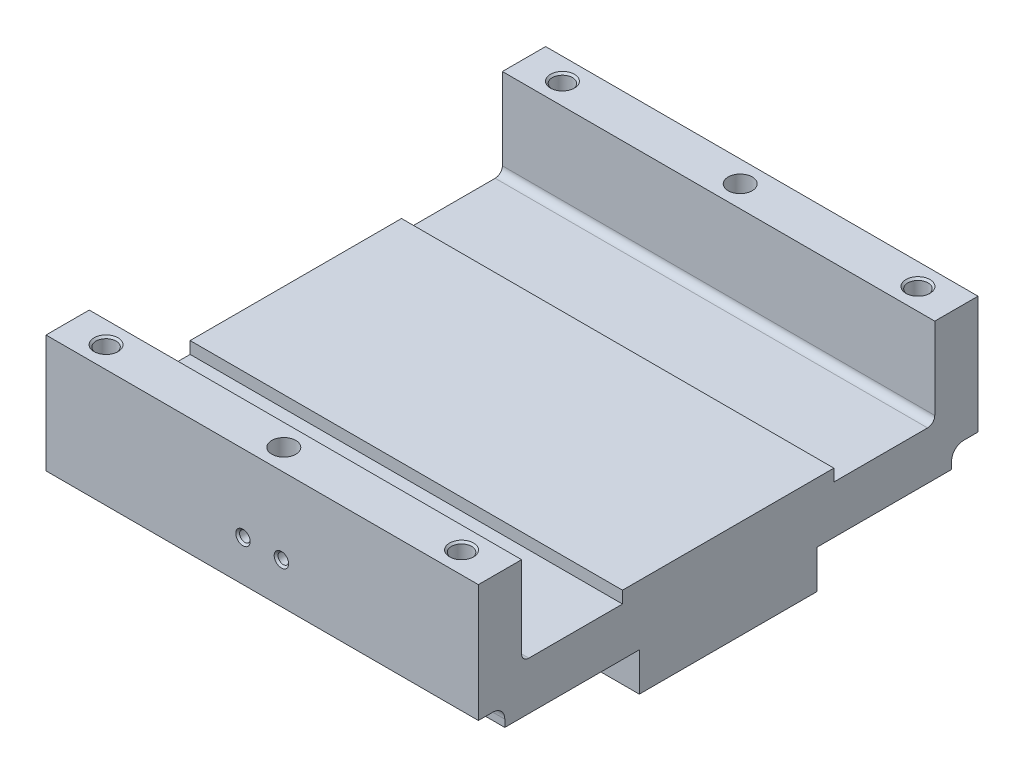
ISO-10303-21;
HEADER;
FILE_DESCRIPTION(('STEP AP214'),'2;1');
FILE_NAME('part.step','',(''),(''),'','','');
FILE_SCHEMA(('AUTOMOTIVE_DESIGN { 1 0 10303 214 1 1 1 1 }'));
ENDSEC;
DATA;
#1=APPLICATION_CONTEXT('core data for automotive mechanical design processes');
#2=APPLICATION_PROTOCOL_DEFINITION('international standard','automotive_design',2000,#1);
#3=PRODUCT_CONTEXT('',#1,'mechanical');
#4=PRODUCT('Part','Part','',(#3));
#5=PRODUCT_RELATED_PRODUCT_CATEGORY('part','',(#4));
#6=PRODUCT_DEFINITION_FORMATION('','',#4);
#7=PRODUCT_DEFINITION_CONTEXT('part definition',#1,'design');
#8=PRODUCT_DEFINITION('design','',#6,#7);
#9=PRODUCT_DEFINITION_SHAPE('','',#8);
#10=(LENGTH_UNIT() NAMED_UNIT(*) SI_UNIT(.MILLI.,.METRE.));
#11=(NAMED_UNIT(*) PLANE_ANGLE_UNIT() SI_UNIT($,.RADIAN.));
#12=(NAMED_UNIT(*) SI_UNIT($,.STERADIAN.) SOLID_ANGLE_UNIT());
#13=UNCERTAINTY_MEASURE_WITH_UNIT(LENGTH_MEASURE(1.E-05),#10,'distance_accuracy_value','');
#14=(GEOMETRIC_REPRESENTATION_CONTEXT(3) GLOBAL_UNCERTAINTY_ASSIGNED_CONTEXT((#13)) GLOBAL_UNIT_ASSIGNED_CONTEXT((#10,
#11,#12)) REPRESENTATION_CONTEXT('',''));
#15=CARTESIAN_POINT('',(0.,0.,0.));
#16=DIRECTION('',(0.,0.,1.));
#17=DIRECTION('',(1.,0.,0.));
#18=AXIS2_PLACEMENT_3D('',#15,#16,#17);
#19=CARTESIAN_POINT('',(-5.,55.,47.5));
#20=DIRECTION('',(0.,1.,0.));
#21=DIRECTION('',(0.,0.,1.));
#22=AXIS2_PLACEMENT_3D('',#19,#20,#21);
#23=PLANE('',#22);
#24=CARTESIAN_POINT('',(-5.,55.,47.5));
#25=DIRECTION('',(0.,1.,0.));
#26=DIRECTION('',(0.,0.,1.));
#27=AXIS2_PLACEMENT_3D('',#24,#25,#26);
#28=CIRCLE('',#27,2.1);
#29=CARTESIAN_POINT('',(-5.,55.,49.6));
#30=VERTEX_POINT('',#29);
#31=EDGE_CURVE('E20',#30,#30,#28,.T.);
#32=ORIENTED_EDGE('',*,*,#31,.T.);
#33=EDGE_LOOP('',(#32));
#34=FACE_BOUND('',#33,.T.);
#35=ADVANCED_FACE('F17',(#34),#23,.T.);
#36=CARTESIAN_POINT('',(-79.,55.,47.5));
#37=DIRECTION('',(0.,1.,0.));
#38=DIRECTION('',(0.,0.,1.));
#39=AXIS2_PLACEMENT_3D('',#36,#37,#38);
#40=PLANE('',#39);
#41=CARTESIAN_POINT('',(-79.,55.,47.5));
#42=DIRECTION('',(0.,1.,0.));
#43=DIRECTION('',(0.,0.,1.));
#44=AXIS2_PLACEMENT_3D('',#41,#42,#43);
#45=CIRCLE('',#44,2.1);
#46=CARTESIAN_POINT('',(-79.,55.,49.6));
#47=VERTEX_POINT('',#46);
#48=EDGE_CURVE('E253',#47,#47,#45,.T.);
#49=ORIENTED_EDGE('',*,*,#48,.T.);
#50=EDGE_LOOP('',(#49));
#51=FACE_BOUND('',#50,.T.);
#52=ADVANCED_FACE('F775',(#51),#40,.T.);
#53=CARTESIAN_POINT('',(-46.,54.,44.));
#54=DIRECTION('',(0.,0.,1.));
#55=DIRECTION('',(1.,0.,0.));
#56=AXIS2_PLACEMENT_3D('',#53,#54,#55);
#57=PLANE('',#56);
#58=CARTESIAN_POINT('',(-46.,54.,44.));
#59=DIRECTION('',(0.,0.,1.));
#60=DIRECTION('',(1.,0.,0.));
#61=AXIS2_PLACEMENT_3D('',#58,#59,#60);
#62=CIRCLE('',#61,1.1);
#63=CARTESIAN_POINT('',(-44.9,54.,44.));
#64=VERTEX_POINT('',#63);
#65=EDGE_CURVE('E251',#64,#64,#62,.T.);
#66=ORIENTED_EDGE('',*,*,#65,.T.);
#67=EDGE_LOOP('',(#66));
#68=FACE_BOUND('',#67,.T.);
#69=ADVANCED_FACE('F772',(#68),#57,.T.);
#70=CARTESIAN_POINT('',(-38.,54.,44.));
#71=DIRECTION('',(0.,0.,1.));
#72=DIRECTION('',(1.,0.,0.));
#73=AXIS2_PLACEMENT_3D('',#70,#71,#72);
#74=PLANE('',#73);
#75=CARTESIAN_POINT('',(-38.,54.,44.));
#76=DIRECTION('',(0.,0.,1.));
#77=DIRECTION('',(1.,0.,0.));
#78=AXIS2_PLACEMENT_3D('',#75,#76,#77);
#79=CIRCLE('',#78,1.1);
#80=CARTESIAN_POINT('',(-36.9,54.,44.));
#81=VERTEX_POINT('',#80);
#82=EDGE_CURVE('E248',#81,#81,#79,.T.);
#83=ORIENTED_EDGE('',*,*,#82,.T.);
#84=EDGE_LOOP('',(#83));
#85=FACE_BOUND('',#84,.T.);
#86=ADVANCED_FACE('F768',(#85),#74,.T.);
#87=CARTESIAN_POINT('',(-38.,54.,-44.));
#88=DIRECTION('',(0.,0.,1.));
#89=DIRECTION('',(1.,0.,0.));
#90=AXIS2_PLACEMENT_3D('',#87,#88,#89);
#91=PLANE('',#90);
#92=CARTESIAN_POINT('',(-38.,54.,-44.));
#93=DIRECTION('',(0.,0.,1.));
#94=DIRECTION('',(1.,0.,0.));
#95=AXIS2_PLACEMENT_3D('',#92,#93,#94);
#96=CIRCLE('',#95,1.1);
#97=CARTESIAN_POINT('',(-36.9,54.,-44.));
#98=VERTEX_POINT('',#97);
#99=EDGE_CURVE('E245',#98,#98,#96,.F.);
#100=ORIENTED_EDGE('',*,*,#99,.T.);
#101=EDGE_LOOP('',(#100));
#102=FACE_BOUND('',#101,.T.);
#103=ADVANCED_FACE('F764',(#102),#91,.F.);
#104=CARTESIAN_POINT('',(-46.,54.,-44.));
#105=DIRECTION('',(0.,0.,1.));
#106=DIRECTION('',(1.,0.,0.));
#107=AXIS2_PLACEMENT_3D('',#104,#105,#106);
#108=PLANE('',#107);
#109=CARTESIAN_POINT('',(-46.,54.,-44.));
#110=DIRECTION('',(0.,0.,1.));
#111=DIRECTION('',(1.,0.,0.));
#112=AXIS2_PLACEMENT_3D('',#109,#110,#111);
#113=CIRCLE('',#112,1.1);
#114=CARTESIAN_POINT('',(-44.9,54.,-44.));
#115=VERTEX_POINT('',#114);
#116=EDGE_CURVE('E242',#115,#115,#113,.F.);
#117=ORIENTED_EDGE('',*,*,#116,.T.);
#118=EDGE_LOOP('',(#117));
#119=FACE_BOUND('',#118,.T.);
#120=ADVANCED_FACE('F760',(#119),#108,.F.);
#121=CARTESIAN_POINT('',(-79.,55.,-47.5));
#122=DIRECTION('',(0.,1.,0.));
#123=DIRECTION('',(0.,0.,1.));
#124=AXIS2_PLACEMENT_3D('',#121,#122,#123);
#125=PLANE('',#124);
#126=CARTESIAN_POINT('',(-79.,55.,-47.5));
#127=DIRECTION('',(0.,1.,0.));
#128=DIRECTION('',(0.,0.,1.));
#129=AXIS2_PLACEMENT_3D('',#126,#127,#128);
#130=CIRCLE('',#129,2.1);
#131=CARTESIAN_POINT('',(-79.,55.,-45.4));
#132=VERTEX_POINT('',#131);
#133=EDGE_CURVE('E239',#132,#132,#130,.T.);
#134=ORIENTED_EDGE('',*,*,#133,.T.);
#135=EDGE_LOOP('',(#134));
#136=FACE_BOUND('',#135,.T.);
#137=ADVANCED_FACE('F756',(#136),#125,.T.);
#138=CARTESIAN_POINT('',(-5.,55.,-47.5));
#139=DIRECTION('',(0.,1.,0.));
#140=DIRECTION('',(0.,0.,1.));
#141=AXIS2_PLACEMENT_3D('',#138,#139,#140);
#142=PLANE('',#141);
#143=CARTESIAN_POINT('',(-5.,55.,-47.5));
#144=DIRECTION('',(0.,1.,0.));
#145=DIRECTION('',(0.,0.,1.));
#146=AXIS2_PLACEMENT_3D('',#143,#144,#145);
#147=CIRCLE('',#146,2.1);
#148=CARTESIAN_POINT('',(-5.,55.,-45.4));
#149=VERTEX_POINT('',#148);
#150=EDGE_CURVE('E235',#149,#149,#147,.T.);
#151=ORIENTED_EDGE('',*,*,#150,.T.);
#152=EDGE_LOOP('',(#151));
#153=FACE_BOUND('',#152,.T.);
#154=ADVANCED_FACE('F265',(#153),#142,.T.);
#155=CARTESIAN_POINT('',(-5.,54.708,47.5));
#156=DIRECTION('',(0.,1.,0.));
#157=DIRECTION('',(0.,0.,1.));
#158=AXIS2_PLACEMENT_3D('',#155,#156,#157);
#159=CYLINDRICAL_SURFACE('',#158,2.1);
#160=ORIENTED_EDGE('',*,*,#31,.F.);
#161=EDGE_LOOP('',(#160));
#162=FACE_BOUND('',#161,.T.);
#163=CARTESIAN_POINT('',(-5.,69.6000000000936,47.5));
#164=DIRECTION('',(0.,1.,0.));
#165=DIRECTION('',(0.,0.,1.));
#166=AXIS2_PLACEMENT_3D('',#163,#164,#165);
#167=CIRCLE('',#166,2.10000000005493);
#168=CARTESIAN_POINT('',(-5.,69.6000000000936,49.6000000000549));
#169=VERTEX_POINT('',#168);
#170=EDGE_CURVE('E238',#169,#169,#167,.T.);
#171=ORIENTED_EDGE('',*,*,#170,.T.);
#172=EDGE_LOOP('',(#171));
#173=FACE_BOUND('',#172,.T.);
#174=ADVANCED_FACE('F261',(#162,#173),#159,.F.);
#175=CARTESIAN_POINT('',(-79.,54.708,47.5));
#176=DIRECTION('',(0.,1.,0.));
#177=DIRECTION('',(0.,0.,1.));
#178=AXIS2_PLACEMENT_3D('',#175,#176,#177);
#179=CYLINDRICAL_SURFACE('',#178,2.1);
#180=ORIENTED_EDGE('',*,*,#48,.F.);
#181=EDGE_LOOP('',(#180));
#182=FACE_BOUND('',#181,.T.);
#183=CARTESIAN_POINT('',(-79.,69.5999999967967,47.5));
#184=DIRECTION('',(0.,1.,0.));
#185=DIRECTION('',(0.,0.,1.));
#186=AXIS2_PLACEMENT_3D('',#183,#184,#185);
#187=CIRCLE('',#186,2.09999999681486);
#188=CARTESIAN_POINT('',(-79.,69.5999999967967,49.5999999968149));
#189=VERTEX_POINT('',#188);
#190=EDGE_CURVE('E234',#189,#189,#187,.T.);
#191=ORIENTED_EDGE('',*,*,#190,.T.);
#192=EDGE_LOOP('',(#191));
#193=FACE_BOUND('',#192,.T.);
#194=ADVANCED_FACE('F264',(#182,#193),#179,.F.);
#195=CARTESIAN_POINT('',(-42.,58.,47.5));
#196=DIRECTION('',(0.,1.,0.));
#197=DIRECTION('',(0.,0.,1.));
#198=AXIS2_PLACEMENT_3D('',#195,#196,#197);
#199=PLANE('',#198);
#200=CARTESIAN_POINT('',(-42.,58.,47.5));
#201=DIRECTION('',(0.,1.,0.));
#202=DIRECTION('',(0.,0.,1.));
#203=AXIS2_PLACEMENT_3D('',#200,#201,#202);
#204=CIRCLE('',#203,2.5);
#205=CARTESIAN_POINT('',(-42.,58.,50.));
#206=VERTEX_POINT('',#205);
#207=EDGE_CURVE('E230',#206,#206,#204,.T.);
#208=ORIENTED_EDGE('',*,*,#207,.T.);
#209=EDGE_LOOP('',(#208));
#210=FACE_BOUND('',#209,.T.);
#211=ADVANCED_FACE('F746',(#210),#199,.T.);
#212=CARTESIAN_POINT('',(-46.,54.,43.81481079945));
#213=DIRECTION('',(0.,0.,1.));
#214=DIRECTION('',(1.,0.,0.));
#215=AXIS2_PLACEMENT_3D('',#212,#213,#214);
#216=CYLINDRICAL_SURFACE('',#215,1.1);
#217=ORIENTED_EDGE('',*,*,#65,.F.);
#218=EDGE_LOOP('',(#217));
#219=FACE_BOUND('',#218,.T.);
#220=CARTESIAN_POINT('',(-46.,54.,51.5999999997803));
#221=DIRECTION('',(0.,0.,1.));
#222=DIRECTION('',(1.,0.,0.));
#223=AXIS2_PLACEMENT_3D('',#220,#221,#222);
#224=CIRCLE('',#223,1.09999999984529);
#225=CARTESIAN_POINT('',(-44.9000000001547,54.,51.5999999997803));
#226=VERTEX_POINT('',#225);
#227=EDGE_CURVE('E233',#226,#226,#224,.T.);
#228=ORIENTED_EDGE('',*,*,#227,.T.);
#229=EDGE_LOOP('',(#228));
#230=FACE_BOUND('',#229,.T.);
#231=ADVANCED_FACE('F344',(#219,#230),#216,.F.);
#232=CARTESIAN_POINT('',(-38.,54.,43.81481079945));
#233=DIRECTION('',(0.,0.,1.));
#234=DIRECTION('',(1.,0.,0.));
#235=AXIS2_PLACEMENT_3D('',#232,#233,#234);
#236=CYLINDRICAL_SURFACE('',#235,1.1);
#237=ORIENTED_EDGE('',*,*,#82,.F.);
#238=EDGE_LOOP('',(#237));
#239=FACE_BOUND('',#238,.T.);
#240=CARTESIAN_POINT('',(-38.,54.,51.5999999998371));
#241=DIRECTION('',(0.,0.,1.));
#242=DIRECTION('',(1.,0.,0.));
#243=AXIS2_PLACEMENT_3D('',#240,#241,#242);
#244=CIRCLE('',#243,1.09999999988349);
#245=CARTESIAN_POINT('',(-36.9000000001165,54.,51.5999999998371));
#246=VERTEX_POINT('',#245);
#247=EDGE_CURVE('E338',#246,#246,#244,.T.);
#248=ORIENTED_EDGE('',*,*,#247,.T.);
#249=EDGE_LOOP('',(#248));
#250=FACE_BOUND('',#249,.T.);
#251=ADVANCED_FACE('F739',(#239,#250),#236,.F.);
#252=CARTESIAN_POINT('',(-38.,54.,-51.78518920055));
#253=DIRECTION('',(0.,0.,1.));
#254=DIRECTION('',(1.,0.,0.));
#255=AXIS2_PLACEMENT_3D('',#252,#253,#254);
#256=CYLINDRICAL_SURFACE('',#255,1.1);
#257=CARTESIAN_POINT('',(-38.,54.,-51.599999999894));
#258=DIRECTION('',(0.,0.,-1.));
#259=DIRECTION('',(-1.,0.,0.));
#260=AXIS2_PLACEMENT_3D('',#257,#258,#259);
#261=CIRCLE('',#260,1.09999999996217);
#262=CARTESIAN_POINT('',(-39.0999999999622,54.,-51.599999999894));
#263=VERTEX_POINT('',#262);
#264=EDGE_CURVE('E550',#263,#263,#261,.T.);
#265=ORIENTED_EDGE('',*,*,#264,.T.);
#266=EDGE_LOOP('',(#265));
#267=FACE_BOUND('',#266,.T.);
#268=ORIENTED_EDGE('',*,*,#99,.F.);
#269=EDGE_LOOP('',(#268));
#270=FACE_BOUND('',#269,.T.);
#271=ADVANCED_FACE('F735',(#267,#270),#256,.F.);
#272=CARTESIAN_POINT('',(-46.,54.,-51.78518920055));
#273=DIRECTION('',(0.,0.,1.));
#274=DIRECTION('',(1.,0.,0.));
#275=AXIS2_PLACEMENT_3D('',#272,#273,#274);
#276=CYLINDRICAL_SURFACE('',#275,1.1);
#277=CARTESIAN_POINT('',(-46.,54.,-51.599999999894));
#278=DIRECTION('',(0.,0.,-1.));
#279=DIRECTION('',(-1.,0.,0.));
#280=AXIS2_PLACEMENT_3D('',#277,#278,#279);
#281=CIRCLE('',#280,1.09999999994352);
#282=CARTESIAN_POINT('',(-47.0999999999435,54.,-51.599999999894));
#283=VERTEX_POINT('',#282);
#284=EDGE_CURVE('E563',#283,#283,#281,.T.);
#285=ORIENTED_EDGE('',*,*,#284,.T.);
#286=EDGE_LOOP('',(#285));
#287=FACE_BOUND('',#286,.T.);
#288=ORIENTED_EDGE('',*,*,#116,.F.);
#289=EDGE_LOOP('',(#288));
#290=FACE_BOUND('',#289,.T.);
#291=ADVANCED_FACE('F731',(#287,#290),#276,.F.);
#292=CARTESIAN_POINT('',(-79.,54.708,-47.5));
#293=DIRECTION('',(0.,1.,0.));
#294=DIRECTION('',(0.,0.,1.));
#295=AXIS2_PLACEMENT_3D('',#292,#293,#294);
#296=CYLINDRICAL_SURFACE('',#295,2.1);
#297=ORIENTED_EDGE('',*,*,#133,.F.);
#298=EDGE_LOOP('',(#297));
#299=FACE_BOUND('',#298,.T.);
#300=CARTESIAN_POINT('',(-79.,69.5999999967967,-47.5));
#301=DIRECTION('',(0.,1.,0.));
#302=DIRECTION('',(0.,0.,1.));
#303=AXIS2_PLACEMENT_3D('',#300,#301,#302);
#304=CIRCLE('',#303,2.09999999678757);
#305=CARTESIAN_POINT('',(-79.,69.5999999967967,-45.4000000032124));
#306=VERTEX_POINT('',#305);
#307=EDGE_CURVE('E560',#306,#306,#304,.T.);
#308=ORIENTED_EDGE('',*,*,#307,.T.);
#309=EDGE_LOOP('',(#308));
#310=FACE_BOUND('',#309,.T.);
#311=ADVANCED_FACE('F727',(#299,#310),#296,.F.);
#312=CARTESIAN_POINT('',(-5.,54.708,-47.5));
#313=DIRECTION('',(0.,1.,0.));
#314=DIRECTION('',(0.,0.,1.));
#315=AXIS2_PLACEMENT_3D('',#312,#313,#314);
#316=CYLINDRICAL_SURFACE('',#315,2.1);
#317=ORIENTED_EDGE('',*,*,#150,.F.);
#318=EDGE_LOOP('',(#317));
#319=FACE_BOUND('',#318,.T.);
#320=CARTESIAN_POINT('',(-5.,69.6000000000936,-47.5));
#321=DIRECTION('',(0.,1.,0.));
#322=DIRECTION('',(0.,0.,1.));
#323=AXIS2_PLACEMENT_3D('',#320,#321,#322);
#324=CIRCLE('',#323,2.10000000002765);
#325=CARTESIAN_POINT('',(-5.,69.6000000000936,-45.3999999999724));
#326=VERTEX_POINT('',#325);
#327=EDGE_CURVE('E229',#326,#326,#324,.T.);
#328=ORIENTED_EDGE('',*,*,#327,.T.);
#329=EDGE_LOOP('',(#328));
#330=FACE_BOUND('',#329,.T.);
#331=ADVANCED_FACE('F720',(#319,#330),#316,.F.);
#332=CARTESIAN_POINT('',(-42.,58.,-47.5));
#333=DIRECTION('',(0.,1.,0.));
#334=DIRECTION('',(0.,0.,1.));
#335=AXIS2_PLACEMENT_3D('',#332,#333,#334);
#336=PLANE('',#335);
#337=CARTESIAN_POINT('',(-42.,58.,-47.5));
#338=DIRECTION('',(0.,1.,0.));
#339=DIRECTION('',(0.,0.,1.));
#340=AXIS2_PLACEMENT_3D('',#337,#338,#339);
#341=CIRCLE('',#340,2.5);
#342=CARTESIAN_POINT('',(-42.,58.,-45.));
#343=VERTEX_POINT('',#342);
#344=EDGE_CURVE('E226',#343,#343,#341,.T.);
#345=ORIENTED_EDGE('',*,*,#344,.T.);
#346=EDGE_LOOP('',(#345));
#347=FACE_BOUND('',#346,.T.);
#348=ADVANCED_FACE('F712',(#347),#336,.T.);
#349=CARTESIAN_POINT('',(-5.,70.00000000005,47.5));
#350=DIRECTION('',(0.,1.,0.));
#351=DIRECTION('',(0.,0.,1.));
#352=AXIS2_PLACEMENT_3D('',#349,#350,#351);
#353=CONICAL_SURFACE('',#352,2.50000000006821,0.785398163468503);
#354=ORIENTED_EDGE('',*,*,#170,.F.);
#355=EDGE_LOOP('',(#354));
#356=FACE_BOUND('',#355,.T.);
#357=CARTESIAN_POINT('',(-5.,70.0000000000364,47.5));
#358=DIRECTION('',(0.,1.,0.));
#359=DIRECTION('',(0.,0.,1.));
#360=AXIS2_PLACEMENT_3D('',#357,#358,#359);
#361=CIRCLE('',#360,2.50000000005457);
#362=CARTESIAN_POINT('',(-5.,70.0000000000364,50.0000000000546));
#363=VERTEX_POINT('',#362);
#364=EDGE_CURVE('E170',#363,#363,#361,.F.);
#365=ORIENTED_EDGE('',*,*,#364,.F.);
#366=EDGE_LOOP('',(#365));
#367=FACE_BOUND('',#366,.T.);
#368=ADVANCED_FACE('F709',(#356,#367),#353,.F.);
#369=CARTESIAN_POINT('',(-79.,69.9999999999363,47.5));
#370=DIRECTION('',(0.,1.,0.));
#371=DIRECTION('',(0.,0.,1.));
#372=AXIS2_PLACEMENT_3D('',#369,#370,#371);
#373=CONICAL_SURFACE('',#372,2.49999999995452,0.785398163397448);
#374=ORIENTED_EDGE('',*,*,#190,.F.);
#375=EDGE_LOOP('',(#374));
#376=FACE_BOUND('',#375,.T.);
#377=CARTESIAN_POINT('',(-79.,69.9999999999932,47.5));
#378=DIRECTION('',(0.,1.,0.));
#379=DIRECTION('',(0.,0.,1.));
#380=AXIS2_PLACEMENT_3D('',#377,#378,#379);
#381=CIRCLE('',#380,2.50000000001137);
#382=CARTESIAN_POINT('',(-79.,69.9999999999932,50.0000000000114));
#383=VERTEX_POINT('',#382);
#384=EDGE_CURVE('E221',#383,#383,#381,.F.);
#385=ORIENTED_EDGE('',*,*,#384,.F.);
#386=EDGE_LOOP('',(#385));
#387=FACE_BOUND('',#386,.T.);
#388=ADVANCED_FACE('F711',(#376,#387),#373,.F.);
#389=CARTESIAN_POINT('',(-42.,57.76,47.5));
#390=DIRECTION('',(0.,1.,0.));
#391=DIRECTION('',(0.,0.,1.));
#392=AXIS2_PLACEMENT_3D('',#389,#390,#391);
#393=CYLINDRICAL_SURFACE('',#392,2.5);
#394=ORIENTED_EDGE('',*,*,#207,.F.);
#395=EDGE_LOOP('',(#394));
#396=FACE_BOUND('',#395,.T.);
#397=CARTESIAN_POINT('',(-42.,70.,47.5));
#398=DIRECTION('',(0.,1.,0.));
#399=DIRECTION('',(0.,0.,1.));
#400=AXIS2_PLACEMENT_3D('',#397,#398,#399);
#401=CIRCLE('',#400,2.5);
#402=CARTESIAN_POINT('',(-42.,70.,50.));
#403=VERTEX_POINT('',#402);
#404=EDGE_CURVE('E218',#403,#403,#401,.F.);
#405=ORIENTED_EDGE('',*,*,#404,.F.);
#406=EDGE_LOOP('',(#405));
#407=FACE_BOUND('',#406,.T.);
#408=ADVANCED_FACE('F350',(#396,#407),#393,.F.);
#409=CARTESIAN_POINT('',(-46.,54.,51.9999999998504));
#410=DIRECTION('',(0.,0.,1.));
#411=DIRECTION('',(1.,0.,0.));
#412=AXIS2_PLACEMENT_3D('',#409,#410,#411);
#413=CONICAL_SURFACE('',#412,1.49999999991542,0.785398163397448);
#414=ORIENTED_EDGE('',*,*,#227,.F.);
#415=EDGE_LOOP('',(#414));
#416=FACE_BOUND('',#415,.T.);
#417=CARTESIAN_POINT('',(-46.,54.,51.9999999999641));
#418=DIRECTION('',(0.,0.,1.));
#419=DIRECTION('',(1.,0.,0.));
#420=AXIS2_PLACEMENT_3D('',#417,#418,#419);
#421=CIRCLE('',#420,1.5000000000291);
#422=CARTESIAN_POINT('',(-44.4999999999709,54.,51.9999999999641));
#423=VERTEX_POINT('',#422);
#424=EDGE_CURVE('E215',#423,#423,#421,.F.);
#425=ORIENTED_EDGE('',*,*,#424,.F.);
#426=EDGE_LOOP('',(#425));
#427=FACE_BOUND('',#426,.T.);
#428=ADVANCED_FACE('F346',(#416,#427),#413,.F.);
#429=CARTESIAN_POINT('',(-38.,54.,51.9999999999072));
#430=DIRECTION('',(0.,0.,1.));
#431=DIRECTION('',(1.,0.,0.));
#432=AXIS2_PLACEMENT_3D('',#429,#430,#431);
#433=CONICAL_SURFACE('',#432,1.49999999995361,0.785398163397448);
#434=ORIENTED_EDGE('',*,*,#247,.F.);
#435=EDGE_LOOP('',(#434));
#436=FACE_BOUND('',#435,.T.);
#437=CARTESIAN_POINT('',(-38.,54.,51.9999999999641));
#438=DIRECTION('',(0.,0.,1.));
#439=DIRECTION('',(1.,0.,0.));
#440=AXIS2_PLACEMENT_3D('',#437,#438,#439);
#441=CIRCLE('',#440,1.50000000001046);
#442=CARTESIAN_POINT('',(-36.4999999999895,54.,51.9999999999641));
#443=VERTEX_POINT('',#442);
#444=EDGE_CURVE('E211',#443,#443,#441,.F.);
#445=ORIENTED_EDGE('',*,*,#444,.F.);
#446=EDGE_LOOP('',(#445));
#447=FACE_BOUND('',#446,.T.);
#448=ADVANCED_FACE('F349',(#436,#447),#433,.F.);
#449=CARTESIAN_POINT('',(-42.,42.25,46.5));
#450=DIRECTION('',(0.,0.,1.));
#451=DIRECTION('',(1.,0.,0.));
#452=AXIS2_PLACEMENT_3D('',#449,#450,#451);
#453=PLANE('',#452);
#454=DIRECTION('',(0.,1.,0.));
#455=VECTOR('',#454,1.);
#456=CARTESIAN_POINT('',(3.,42.25,46.5));
#457=LINE('',#456,#455);
#458=CARTESIAN_POINT('',(3.,41.5,46.5));
#459=VERTEX_POINT('',#458);
#460=CARTESIAN_POINT('',(3.,43.,46.5));
#461=VERTEX_POINT('',#460);
#462=EDGE_CURVE('E462',#459,#461,#457,.T.);
#463=ORIENTED_EDGE('',*,*,#462,.T.);
#464=DIRECTION('',(-1.,0.,0.));
#465=VECTOR('',#464,1.);
#466=CARTESIAN_POINT('',(4.8,43.,46.5));
#467=LINE('',#466,#465);
#468=CARTESIAN_POINT('',(-87.,43.,46.5));
#469=VERTEX_POINT('',#468);
#470=EDGE_CURVE('E452',#461,#469,#467,.T.);
#471=ORIENTED_EDGE('',*,*,#470,.T.);
#472=DIRECTION('',(0.,1.,0.));
#473=VECTOR('',#472,1.);
#474=CARTESIAN_POINT('',(-87.,42.25,46.5));
#475=LINE('',#474,#473);
#476=CARTESIAN_POINT('',(-87.,41.5,46.5));
#477=VERTEX_POINT('',#476);
#478=EDGE_CURVE('E340',#469,#477,#475,.F.);
#479=ORIENTED_EDGE('',*,*,#478,.T.);
#480=DIRECTION('',(1.,0.,0.));
#481=VECTOR('',#480,1.);
#482=CARTESIAN_POINT('',(-42.,41.5,46.5));
#483=LINE('',#482,#481);
#484=EDGE_CURVE('E320',#477,#459,#483,.T.);
#485=ORIENTED_EDGE('',*,*,#484,.T.);
#486=EDGE_LOOP('',(#463,#471,#479,#485));
#487=FACE_BOUND('',#486,.T.);
#488=ADVANCED_FACE('F464',(#487),#453,.T.);
#489=CARTESIAN_POINT('',(-42.,42.25,-46.5));
#490=DIRECTION('',(0.,0.,1.));
#491=DIRECTION('',(1.,0.,0.));
#492=AXIS2_PLACEMENT_3D('',#489,#490,#491);
#493=PLANE('',#492);
#494=DIRECTION('',(1.,0.,0.));
#495=VECTOR('',#494,1.);
#496=CARTESIAN_POINT('',(-42.,41.5,-46.5));
#497=LINE('',#496,#495);
#498=CARTESIAN_POINT('',(3.,41.5,-46.5));
#499=VERTEX_POINT('',#498);
#500=CARTESIAN_POINT('',(-87.,41.5,-46.5));
#501=VERTEX_POINT('',#500);
#502=EDGE_CURVE('E567',#499,#501,#497,.F.);
#503=ORIENTED_EDGE('',*,*,#502,.T.);
#504=DIRECTION('',(0.,1.,0.));
#505=VECTOR('',#504,1.);
#506=CARTESIAN_POINT('',(-87.,42.25,-46.5));
#507=LINE('',#506,#505);
#508=CARTESIAN_POINT('',(-87.,43.,-46.5));
#509=VERTEX_POINT('',#508);
#510=EDGE_CURVE('E544',#509,#501,#507,.F.);
#511=ORIENTED_EDGE('',*,*,#510,.F.);
#512=DIRECTION('',(-1.,0.,0.));
#513=VECTOR('',#512,1.);
#514=CARTESIAN_POINT('',(4.8,43.,-46.5));
#515=LINE('',#514,#513);
#516=CARTESIAN_POINT('',(3.,43.,-46.5));
#517=VERTEX_POINT('',#516);
#518=EDGE_CURVE('E574',#509,#517,#515,.F.);
#519=ORIENTED_EDGE('',*,*,#518,.T.);
#520=DIRECTION('',(0.,1.,0.));
#521=VECTOR('',#520,1.);
#522=CARTESIAN_POINT('',(3.,42.25,-46.5));
#523=LINE('',#522,#521);
#524=EDGE_CURVE('E546',#499,#517,#523,.T.);
#525=ORIENTED_EDGE('',*,*,#524,.F.);
#526=EDGE_LOOP('',(#503,#511,#519,#525));
#527=FACE_BOUND('',#526,.T.);
#528=ADVANCED_FACE('F682',(#527),#493,.F.);
#529=CARTESIAN_POINT('',(-38.,54.,-51.9999999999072));
#530=DIRECTION('',(0.,0.,-1.));
#531=DIRECTION('',(-1.,0.,0.));
#532=AXIS2_PLACEMENT_3D('',#529,#530,#531);
#533=CONICAL_SURFACE('',#532,1.49999999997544,0.785398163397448);
#534=ORIENTED_EDGE('',*,*,#264,.F.);
#535=EDGE_LOOP('',(#534));
#536=FACE_BOUND('',#535,.T.);
#537=CARTESIAN_POINT('',(-38.,54.,-51.9999999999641));
#538=DIRECTION('',(0.,0.,-1.));
#539=DIRECTION('',(-1.,0.,0.));
#540=AXIS2_PLACEMENT_3D('',#537,#538,#539);
#541=CIRCLE('',#540,1.50000000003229);
#542=CARTESIAN_POINT('',(-39.5000000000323,54.,-51.9999999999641));
#543=VERTEX_POINT('',#542);
#544=EDGE_CURVE('E207',#543,#543,#541,.T.);
#545=ORIENTED_EDGE('',*,*,#544,.T.);
#546=EDGE_LOOP('',(#545));
#547=FACE_BOUND('',#546,.T.);
#548=ADVANCED_FACE('F941',(#536,#547),#533,.F.);
#549=CARTESIAN_POINT('',(-46.,54.,-51.9999999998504));
#550=DIRECTION('',(0.,0.,-1.));
#551=DIRECTION('',(-1.,0.,0.));
#552=AXIS2_PLACEMENT_3D('',#549,#550,#551);
#553=CONICAL_SURFACE('',#552,1.49999999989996,0.785398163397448);
#554=ORIENTED_EDGE('',*,*,#284,.F.);
#555=EDGE_LOOP('',(#554));
#556=FACE_BOUND('',#555,.T.);
#557=CARTESIAN_POINT('',(-46.,54.,-51.9999999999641));
#558=DIRECTION('',(0.,0.,-1.));
#559=DIRECTION('',(-1.,0.,0.));
#560=AXIS2_PLACEMENT_3D('',#557,#558,#559);
#561=CIRCLE('',#560,1.50000000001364);
#562=CARTESIAN_POINT('',(-47.5000000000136,54.,-51.9999999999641));
#563=VERTEX_POINT('',#562);
#564=EDGE_CURVE('E204',#563,#563,#561,.T.);
#565=ORIENTED_EDGE('',*,*,#564,.T.);
#566=EDGE_LOOP('',(#565));
#567=FACE_BOUND('',#566,.T.);
#568=ADVANCED_FACE('F950',(#556,#567),#553,.F.);
#569=CARTESIAN_POINT('',(-79.,69.9999999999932,-47.5));
#570=DIRECTION('',(0.,1.,0.));
#571=DIRECTION('',(0.,0.,1.));
#572=AXIS2_PLACEMENT_3D('',#569,#570,#571);
#573=CONICAL_SURFACE('',#572,2.49999999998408,0.785398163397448);
#574=ORIENTED_EDGE('',*,*,#307,.F.);
#575=EDGE_LOOP('',(#574));
#576=FACE_BOUND('',#575,.T.);
#577=CARTESIAN_POINT('',(-79.,70.0000000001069,-47.5));
#578=DIRECTION('',(0.,1.,0.));
#579=DIRECTION('',(0.,0.,1.));
#580=AXIS2_PLACEMENT_3D('',#577,#578,#579);
#581=CIRCLE('',#580,2.50000000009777);
#582=CARTESIAN_POINT('',(-79.,70.0000000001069,-44.9999999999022));
#583=VERTEX_POINT('',#582);
#584=EDGE_CURVE('E200',#583,#583,#581,.F.);
#585=ORIENTED_EDGE('',*,*,#584,.F.);
#586=EDGE_LOOP('',(#585));
#587=FACE_BOUND('',#586,.T.);
#588=ADVANCED_FACE('F960',(#576,#587),#573,.F.);
#589=CARTESIAN_POINT('',(-5.,70.00000000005,-47.5));
#590=DIRECTION('',(0.,1.,0.));
#591=DIRECTION('',(0.,0.,1.));
#592=AXIS2_PLACEMENT_3D('',#589,#590,#591);
#593=CONICAL_SURFACE('',#592,2.50000000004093,0.785398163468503);
#594=ORIENTED_EDGE('',*,*,#327,.F.);
#595=EDGE_LOOP('',(#594));
#596=FACE_BOUND('',#595,.T.);
#597=CARTESIAN_POINT('',(-5.,70.0000000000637,-47.5));
#598=DIRECTION('',(0.,1.,0.));
#599=DIRECTION('',(0.,0.,1.));
#600=AXIS2_PLACEMENT_3D('',#597,#598,#599);
#601=CIRCLE('',#600,2.50000000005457);
#602=CARTESIAN_POINT('',(-5.,70.0000000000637,-44.9999999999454));
#603=VERTEX_POINT('',#602);
#604=EDGE_CURVE('E197',#603,#603,#601,.F.);
#605=ORIENTED_EDGE('',*,*,#604,.F.);
#606=EDGE_LOOP('',(#605));
#607=FACE_BOUND('',#606,.T.);
#608=ADVANCED_FACE('F970',(#596,#607),#593,.F.);
#609=CARTESIAN_POINT('',(-42.,57.76,-47.5));
#610=DIRECTION('',(0.,1.,0.));
#611=DIRECTION('',(0.,0.,1.));
#612=AXIS2_PLACEMENT_3D('',#609,#610,#611);
#613=CYLINDRICAL_SURFACE('',#612,2.5);
#614=ORIENTED_EDGE('',*,*,#344,.F.);
#615=EDGE_LOOP('',(#614));
#616=FACE_BOUND('',#615,.T.);
#617=CARTESIAN_POINT('',(-42.,70.,-47.5));
#618=DIRECTION('',(0.,1.,0.));
#619=DIRECTION('',(0.,0.,1.));
#620=AXIS2_PLACEMENT_3D('',#617,#618,#619);
#621=CIRCLE('',#620,2.5);
#622=CARTESIAN_POINT('',(-42.,70.,-45.));
#623=VERTEX_POINT('',#622);
#624=EDGE_CURVE('E193',#623,#623,#621,.F.);
#625=ORIENTED_EDGE('',*,*,#624,.F.);
#626=EDGE_LOOP('',(#625));
#627=FACE_BOUND('',#626,.T.);
#628=ADVANCED_FACE('F980',(#616,#627),#613,.F.);
#629=CARTESIAN_POINT('',(-42.,51.5,31.75));
#630=DIRECTION('',(0.,1.,0.));
#631=DIRECTION('',(0.,0.,1.));
#632=AXIS2_PLACEMENT_3D('',#629,#630,#631);
#633=PLANE('',#632);
#634=DIRECTION('',(0.,0.,-1.));
#635=VECTOR('',#634,1.);
#636=CARTESIAN_POINT('',(-87.,51.5,0.));
#637=LINE('',#636,#635);
#638=CARTESIAN_POINT('',(-87.,51.5,22.));
#639=VERTEX_POINT('',#638);
#640=CARTESIAN_POINT('',(-87.,51.5,41.5));
#641=VERTEX_POINT('',#640);
#642=EDGE_CURVE('E290',#639,#641,#637,.F.);
#643=ORIENTED_EDGE('',*,*,#642,.T.);
#644=DIRECTION('',(-1.,0.,0.));
#645=VECTOR('',#644,1.);
#646=CARTESIAN_POINT('',(4.8,51.5,41.5));
#647=LINE('',#646,#645);
#648=CARTESIAN_POINT('',(3.,51.5,41.5));
#649=VERTEX_POINT('',#648);
#650=EDGE_CURVE('E155',#641,#649,#647,.F.);
#651=ORIENTED_EDGE('',*,*,#650,.T.);
#652=DIRECTION('',(0.,0.,-1.));
#653=VECTOR('',#652,1.);
#654=CARTESIAN_POINT('',(3.,51.5,0.));
#655=LINE('',#654,#653);
#656=CARTESIAN_POINT('',(3.,51.5,22.));
#657=VERTEX_POINT('',#656);
#658=EDGE_CURVE('E185',#657,#649,#655,.F.);
#659=ORIENTED_EDGE('',*,*,#658,.F.);
#660=DIRECTION('',(1.,0.,0.));
#661=VECTOR('',#660,1.);
#662=CARTESIAN_POINT('',(-42.,51.5,22.));
#663=LINE('',#662,#661);
#664=EDGE_CURVE('E494',#639,#657,#663,.T.);
#665=ORIENTED_EDGE('',*,*,#664,.F.);
#666=EDGE_LOOP('',(#643,#651,#659,#665));
#667=FACE_BOUND('',#666,.T.);
#668=ADVANCED_FACE('F990',(#667),#633,.T.);
#669=CARTESIAN_POINT('',(4.8,53.,41.5));
#670=DIRECTION('',(-1.,0.,0.));
#671=DIRECTION('',(0.,0.,1.));
#672=AXIS2_PLACEMENT_3D('',#669,#670,#671);
#673=CYLINDRICAL_SURFACE('',#672,1.5);
#674=ORIENTED_EDGE('',*,*,#650,.F.);
#675=CARTESIAN_POINT('',(-87.,53.,41.5));
#676=DIRECTION('',(-1.,0.,0.));
#677=DIRECTION('',(0.,0.,1.));
#678=AXIS2_PLACEMENT_3D('',#675,#676,#677);
#679=CIRCLE('',#678,1.5);
#680=CARTESIAN_POINT('',(-87.,53.,43.));
#681=VERTEX_POINT('',#680);
#682=EDGE_CURVE('E167',#641,#681,#679,.T.);
#683=ORIENTED_EDGE('',*,*,#682,.T.);
#684=DIRECTION('',(1.,0.,0.));
#685=VECTOR('',#684,1.);
#686=CARTESIAN_POINT('',(-42.,53.,43.));
#687=LINE('',#686,#685);
#688=CARTESIAN_POINT('',(3.,53.,43.));
#689=VERTEX_POINT('',#688);
#690=EDGE_CURVE('E160',#681,#689,#687,.T.);
#691=ORIENTED_EDGE('',*,*,#690,.T.);
#692=CARTESIAN_POINT('',(3.,53.,41.5));
#693=DIRECTION('',(-1.,0.,0.));
#694=DIRECTION('',(0.,0.,1.));
#695=AXIS2_PLACEMENT_3D('',#692,#693,#694);
#696=CIRCLE('',#695,1.5);
#697=EDGE_CURVE('E164',#649,#689,#696,.T.);
#698=ORIENTED_EDGE('',*,*,#697,.F.);
#699=EDGE_LOOP('',(#674,#683,#691,#698));
#700=FACE_BOUND('',#699,.T.);
#701=ADVANCED_FACE('F162',(#700),#673,.F.);
#702=CARTESIAN_POINT('',(-42.,61.5,43.));
#703=DIRECTION('',(0.,0.,1.));
#704=DIRECTION('',(1.,0.,0.));
#705=AXIS2_PLACEMENT_3D('',#702,#703,#704);
#706=PLANE('',#705);
#707=DIRECTION('',(0.,1.,0.));
#708=VECTOR('',#707,1.);
#709=CARTESIAN_POINT('',(-87.,51.75,43.));
#710=LINE('',#709,#708);
#711=CARTESIAN_POINT('',(-87.,70.,43.));
#712=VERTEX_POINT('',#711);
#713=EDGE_CURVE('E289',#681,#712,#710,.T.);
#714=ORIENTED_EDGE('',*,*,#713,.T.);
#715=DIRECTION('',(1.,0.,0.));
#716=VECTOR('',#715,1.);
#717=CARTESIAN_POINT('',(-42.,70.,43.));
#718=LINE('',#717,#716);
#719=CARTESIAN_POINT('',(3.,70.,43.));
#720=VERTEX_POINT('',#719);
#721=EDGE_CURVE('E176',#720,#712,#718,.F.);
#722=ORIENTED_EDGE('',*,*,#721,.F.);
#723=DIRECTION('',(0.,1.,0.));
#724=VECTOR('',#723,1.);
#725=CARTESIAN_POINT('',(3.,51.75,43.));
#726=LINE('',#725,#724);
#727=EDGE_CURVE('E173',#689,#720,#726,.T.);
#728=ORIENTED_EDGE('',*,*,#727,.F.);
#729=ORIENTED_EDGE('',*,*,#690,.F.);
#730=EDGE_LOOP('',(#714,#722,#728,#729));
#731=FACE_BOUND('',#730,.T.);
#732=ADVANCED_FACE('F174',(#731),#706,.F.);
#733=CARTESIAN_POINT('',(-42.,70.,47.5));
#734=DIRECTION('',(0.,1.,0.));
#735=DIRECTION('',(0.,0.,1.));
#736=AXIS2_PLACEMENT_3D('',#733,#734,#735);
#737=PLANE('',#736);
#738=DIRECTION('',(0.,0.,-1.));
#739=VECTOR('',#738,1.);
#740=CARTESIAN_POINT('',(3.,70.,0.));
#741=LINE('',#740,#739);
#742=CARTESIAN_POINT('',(3.,70.,52.));
#743=VERTEX_POINT('',#742);
#744=EDGE_CURVE('E180',#720,#743,#741,.F.);
#745=ORIENTED_EDGE('',*,*,#744,.F.);
#746=ORIENTED_EDGE('',*,*,#721,.T.);
#747=DIRECTION('',(0.,0.,-1.));
#748=VECTOR('',#747,1.);
#749=CARTESIAN_POINT('',(-87.,70.,0.));
#750=LINE('',#749,#748);
#751=CARTESIAN_POINT('',(-87.,70.,52.));
#752=VERTEX_POINT('',#751);
#753=EDGE_CURVE('E475',#712,#752,#750,.F.);
#754=ORIENTED_EDGE('',*,*,#753,.T.);
#755=DIRECTION('',(1.,0.,0.));
#756=VECTOR('',#755,1.);
#757=CARTESIAN_POINT('',(-42.,70.,52.));
#758=LINE('',#757,#756);
#759=EDGE_CURVE('E214',#743,#752,#758,.F.);
#760=ORIENTED_EDGE('',*,*,#759,.F.);
#761=EDGE_LOOP('',(#745,#746,#754,#760));
#762=FACE_BOUND('',#761,.T.);
#763=ORIENTED_EDGE('',*,*,#404,.T.);
#764=EDGE_LOOP('',(#763));
#765=FACE_BOUND('',#764,.T.);
#766=ORIENTED_EDGE('',*,*,#384,.T.);
#767=EDGE_LOOP('',(#766));
#768=FACE_BOUND('',#767,.T.);
#769=ORIENTED_EDGE('',*,*,#364,.T.);
#770=EDGE_LOOP('',(#769));
#771=FACE_BOUND('',#770,.T.);
#772=ADVANCED_FACE('F357',(#762,#765,#768,#771),#737,.T.);
#773=CARTESIAN_POINT('',(-42.,57.75,52.));
#774=DIRECTION('',(0.,0.,1.));
#775=DIRECTION('',(1.,0.,0.));
#776=AXIS2_PLACEMENT_3D('',#773,#774,#775);
#777=PLANE('',#776);
#778=DIRECTION('',(0.,1.,0.));
#779=VECTOR('',#778,1.);
#780=CARTESIAN_POINT('',(3.,51.75,52.));
#781=LINE('',#780,#779);
#782=CARTESIAN_POINT('',(3.,45.5,52.));
#783=VERTEX_POINT('',#782);
#784=EDGE_CURVE('E532',#743,#783,#781,.F.);
#785=ORIENTED_EDGE('',*,*,#784,.F.);
#786=ORIENTED_EDGE('',*,*,#759,.T.);
#787=DIRECTION('',(0.,1.,0.));
#788=VECTOR('',#787,1.);
#789=CARTESIAN_POINT('',(-87.,51.75,52.));
#790=LINE('',#789,#788);
#791=CARTESIAN_POINT('',(-87.,45.5,52.));
#792=VERTEX_POINT('',#791);
#793=EDGE_CURVE('E473',#752,#792,#790,.F.);
#794=ORIENTED_EDGE('',*,*,#793,.T.);
#795=DIRECTION('',(1.,0.,0.));
#796=VECTOR('',#795,1.);
#797=CARTESIAN_POINT('',(-42.,45.5,52.));
#798=LINE('',#797,#796);
#799=EDGE_CURVE('E465',#792,#783,#798,.T.);
#800=ORIENTED_EDGE('',*,*,#799,.T.);
#801=EDGE_LOOP('',(#785,#786,#794,#800));
#802=FACE_BOUND('',#801,.T.);
#803=ORIENTED_EDGE('',*,*,#444,.T.);
#804=EDGE_LOOP('',(#803));
#805=FACE_BOUND('',#804,.T.);
#806=ORIENTED_EDGE('',*,*,#424,.T.);
#807=EDGE_LOOP('',(#806));
#808=FACE_BOUND('',#807,.T.);
#809=ADVANCED_FACE('F354',(#802,#805,#808),#777,.T.);
#810=CARTESIAN_POINT('',(-42.,45.5,50.5));
#811=DIRECTION('',(0.,1.,0.));
#812=DIRECTION('',(0.,0.,1.));
#813=AXIS2_PLACEMENT_3D('',#810,#811,#812);
#814=PLANE('',#813);
#815=ORIENTED_EDGE('',*,*,#799,.F.);
#816=DIRECTION('',(0.,0.,-1.));
#817=VECTOR('',#816,1.);
#818=CARTESIAN_POINT('',(-87.,45.5,0.));
#819=LINE('',#818,#817);
#820=CARTESIAN_POINT('',(-87.,45.5,49.));
#821=VERTEX_POINT('',#820);
#822=EDGE_CURVE('E287',#792,#821,#819,.T.);
#823=ORIENTED_EDGE('',*,*,#822,.T.);
#824=DIRECTION('',(-1.,0.,0.));
#825=VECTOR('',#824,1.);
#826=CARTESIAN_POINT('',(4.8,45.5,49.));
#827=LINE('',#826,#825);
#828=CARTESIAN_POINT('',(3.,45.5,49.));
#829=VERTEX_POINT('',#828);
#830=EDGE_CURVE('E324',#821,#829,#827,.F.);
#831=ORIENTED_EDGE('',*,*,#830,.T.);
#832=DIRECTION('',(0.,0.,-1.));
#833=VECTOR('',#832,1.);
#834=CARTESIAN_POINT('',(3.,45.5,0.));
#835=LINE('',#834,#833);
#836=EDGE_CURVE('E535',#783,#829,#835,.T.);
#837=ORIENTED_EDGE('',*,*,#836,.F.);
#838=EDGE_LOOP('',(#815,#823,#831,#837));
#839=FACE_BOUND('',#838,.T.);
#840=ADVANCED_FACE('F356',(#839),#814,.F.);
#841=CARTESIAN_POINT('',(4.8,43.,49.));
#842=DIRECTION('',(-1.,0.,0.));
#843=DIRECTION('',(0.,0.,1.));
#844=AXIS2_PLACEMENT_3D('',#841,#842,#843);
#845=CYLINDRICAL_SURFACE('',#844,2.5);
#846=ORIENTED_EDGE('',*,*,#830,.F.);
#847=CARTESIAN_POINT('',(-87.,43.,49.));
#848=DIRECTION('',(-1.,0.,0.));
#849=DIRECTION('',(0.,0.,1.));
#850=AXIS2_PLACEMENT_3D('',#847,#848,#849);
#851=CIRCLE('',#850,2.5);
#852=EDGE_CURVE('E283',#821,#469,#851,.T.);
#853=ORIENTED_EDGE('',*,*,#852,.T.);
#854=ORIENTED_EDGE('',*,*,#470,.F.);
#855=CARTESIAN_POINT('',(3.,43.,49.));
#856=DIRECTION('',(-1.,0.,0.));
#857=DIRECTION('',(0.,0.,1.));
#858=AXIS2_PLACEMENT_3D('',#855,#856,#857);
#859=CIRCLE('',#858,2.5);
#860=EDGE_CURVE('E191',#829,#461,#859,.T.);
#861=ORIENTED_EDGE('',*,*,#860,.F.);
#862=EDGE_LOOP('',(#846,#853,#854,#861));
#863=FACE_BOUND('',#862,.T.);
#864=ADVANCED_FACE('F365',(#863),#845,.F.);
#865=CARTESIAN_POINT('',(-42.,41.5,32.5));
#866=DIRECTION('',(0.,1.,0.));
#867=DIRECTION('',(0.,0.,1.));
#868=AXIS2_PLACEMENT_3D('',#865,#866,#867);
#869=PLANE('',#868);
#870=DIRECTION('',(0.,0.,-1.));
#871=VECTOR('',#870,1.);
#872=CARTESIAN_POINT('',(-87.,41.5,0.));
#873=LINE('',#872,#871);
#874=CARTESIAN_POINT('',(-87.,41.5,18.5));
#875=VERTEX_POINT('',#874);
#876=EDGE_CURVE('E286',#477,#875,#873,.T.);
#877=ORIENTED_EDGE('',*,*,#876,.T.);
#878=DIRECTION('',(1.,0.,0.));
#879=VECTOR('',#878,1.);
#880=CARTESIAN_POINT('',(-42.,41.5,18.5));
#881=LINE('',#880,#879);
#882=CARTESIAN_POINT('',(3.,41.5,18.5));
#883=VERTEX_POINT('',#882);
#884=EDGE_CURVE('E323',#883,#875,#881,.F.);
#885=ORIENTED_EDGE('',*,*,#884,.F.);
#886=DIRECTION('',(0.,0.,-1.));
#887=VECTOR('',#886,1.);
#888=CARTESIAN_POINT('',(3.,41.5,0.));
#889=LINE('',#888,#887);
#890=EDGE_CURVE('E327',#459,#883,#889,.T.);
#891=ORIENTED_EDGE('',*,*,#890,.F.);
#892=ORIENTED_EDGE('',*,*,#484,.F.);
#893=EDGE_LOOP('',(#877,#885,#891,#892));
#894=FACE_BOUND('',#893,.T.);
#895=ADVANCED_FACE('F436',(#894),#869,.F.);
#896=CARTESIAN_POINT('',(-42.,37.5,18.5));
#897=DIRECTION('',(0.,0.,1.));
#898=DIRECTION('',(1.,0.,0.));
#899=AXIS2_PLACEMENT_3D('',#896,#897,#898);
#900=PLANE('',#899);
#901=DIRECTION('',(1.,0.,0.));
#902=VECTOR('',#901,1.);
#903=CARTESIAN_POINT('',(-42.,33.5,18.5));
#904=LINE('',#903,#902);
#905=CARTESIAN_POINT('',(-87.,33.5,18.5));
#906=VERTEX_POINT('',#905);
#907=CARTESIAN_POINT('',(3.,33.5,18.5));
#908=VERTEX_POINT('',#907);
#909=EDGE_CURVE('E577',#906,#908,#904,.T.);
#910=ORIENTED_EDGE('',*,*,#909,.T.);
#911=DIRECTION('',(0.,1.,0.));
#912=VECTOR('',#911,1.);
#913=CARTESIAN_POINT('',(3.,51.75,18.5));
#914=LINE('',#913,#912);
#915=EDGE_CURVE('E330',#883,#908,#914,.F.);
#916=ORIENTED_EDGE('',*,*,#915,.F.);
#917=ORIENTED_EDGE('',*,*,#884,.T.);
#918=DIRECTION('',(0.,1.,0.));
#919=VECTOR('',#918,1.);
#920=CARTESIAN_POINT('',(-87.,51.75,18.5));
#921=LINE('',#920,#919);
#922=EDGE_CURVE('E335',#875,#906,#921,.F.);
#923=ORIENTED_EDGE('',*,*,#922,.T.);
#924=EDGE_LOOP('',(#910,#916,#917,#923));
#925=FACE_BOUND('',#924,.T.);
#926=ADVANCED_FACE('F432',(#925),#900,.T.);
#927=CARTESIAN_POINT('',(-42.,33.5,0.));
#928=DIRECTION('',(0.,1.,0.));
#929=DIRECTION('',(0.,0.,1.));
#930=AXIS2_PLACEMENT_3D('',#927,#928,#929);
#931=PLANE('',#930);
#932=ORIENTED_EDGE('',*,*,#909,.F.);
#933=DIRECTION('',(0.,0.,-1.));
#934=VECTOR('',#933,1.);
#935=CARTESIAN_POINT('',(-87.,33.5,0.));
#936=LINE('',#935,#934);
#937=CARTESIAN_POINT('',(-87.,33.5,-18.5));
#938=VERTEX_POINT('',#937);
#939=EDGE_CURVE('E647',#906,#938,#936,.T.);
#940=ORIENTED_EDGE('',*,*,#939,.T.);
#941=DIRECTION('',(1.,0.,0.));
#942=VECTOR('',#941,1.);
#943=CARTESIAN_POINT('',(-42.,33.5,-18.5));
#944=LINE('',#943,#942);
#945=CARTESIAN_POINT('',(3.,33.5,-18.5));
#946=VERTEX_POINT('',#945);
#947=EDGE_CURVE('E570',#938,#946,#944,.T.);
#948=ORIENTED_EDGE('',*,*,#947,.T.);
#949=DIRECTION('',(0.,0.,-1.));
#950=VECTOR('',#949,1.);
#951=CARTESIAN_POINT('',(3.,33.5,0.));
#952=LINE('',#951,#950);
#953=EDGE_CURVE('E307',#908,#946,#952,.T.);
#954=ORIENTED_EDGE('',*,*,#953,.F.);
#955=EDGE_LOOP('',(#932,#940,#948,#954));
#956=FACE_BOUND('',#955,.T.);
#957=ADVANCED_FACE('F428',(#956),#931,.F.);
#958=CARTESIAN_POINT('',(-42.,37.5,-18.5));
#959=DIRECTION('',(0.,0.,1.));
#960=DIRECTION('',(1.,0.,0.));
#961=AXIS2_PLACEMENT_3D('',#958,#959,#960);
#962=PLANE('',#961);
#963=ORIENTED_EDGE('',*,*,#947,.F.);
#964=DIRECTION('',(0.,1.,0.));
#965=VECTOR('',#964,1.);
#966=CARTESIAN_POINT('',(-87.,51.75,-18.5));
#967=LINE('',#966,#965);
#968=CARTESIAN_POINT('',(-87.,41.5,-18.5));
#969=VERTEX_POINT('',#968);
#970=EDGE_CURVE('E317',#938,#969,#967,.T.);
#971=ORIENTED_EDGE('',*,*,#970,.T.);
#972=DIRECTION('',(1.,0.,0.));
#973=VECTOR('',#972,1.);
#974=CARTESIAN_POINT('',(-42.,41.5,-18.5));
#975=LINE('',#974,#973);
#976=CARTESIAN_POINT('',(3.,41.5,-18.5));
#977=VERTEX_POINT('',#976);
#978=EDGE_CURVE('E569',#969,#977,#975,.T.);
#979=ORIENTED_EDGE('',*,*,#978,.T.);
#980=DIRECTION('',(0.,1.,0.));
#981=VECTOR('',#980,1.);
#982=CARTESIAN_POINT('',(3.,51.75,-18.5));
#983=LINE('',#982,#981);
#984=EDGE_CURVE('E303',#946,#977,#983,.T.);
#985=ORIENTED_EDGE('',*,*,#984,.F.);
#986=EDGE_LOOP('',(#963,#971,#979,#985));
#987=FACE_BOUND('',#986,.T.);
#988=ADVANCED_FACE('F424',(#987),#962,.F.);
#989=CARTESIAN_POINT('',(-42.,41.5,-32.5));
#990=DIRECTION('',(0.,1.,0.));
#991=DIRECTION('',(0.,0.,1.));
#992=AXIS2_PLACEMENT_3D('',#989,#990,#991);
#993=PLANE('',#992);
#994=DIRECTION('',(0.,0.,-1.));
#995=VECTOR('',#994,1.);
#996=CARTESIAN_POINT('',(-87.,41.5,0.));
#997=LINE('',#996,#995);
#998=EDGE_CURVE('E282',#969,#501,#997,.T.);
#999=ORIENTED_EDGE('',*,*,#998,.T.);
#1000=ORIENTED_EDGE('',*,*,#502,.F.);
#1001=DIRECTION('',(0.,0.,-1.));
#1002=VECTOR('',#1001,1.);
#1003=CARTESIAN_POINT('',(3.,41.5,0.));
#1004=LINE('',#1003,#1002);
#1005=EDGE_CURVE('E297',#977,#499,#1004,.T.);
#1006=ORIENTED_EDGE('',*,*,#1005,.F.);
#1007=ORIENTED_EDGE('',*,*,#978,.F.);
#1008=EDGE_LOOP('',(#999,#1000,#1006,#1007));
#1009=FACE_BOUND('',#1008,.T.);
#1010=ADVANCED_FACE('F420',(#1009),#993,.F.);
#1011=CARTESIAN_POINT('',(4.8,43.,-49.));
#1012=DIRECTION('',(-1.,0.,0.));
#1013=DIRECTION('',(0.,0.,1.));
#1014=AXIS2_PLACEMENT_3D('',#1011,#1012,#1013);
#1015=CYLINDRICAL_SURFACE('',#1014,2.5);
#1016=ORIENTED_EDGE('',*,*,#518,.F.);
#1017=CARTESIAN_POINT('',(-87.,43.,-49.));
#1018=DIRECTION('',(-1.,0.,0.));
#1019=DIRECTION('',(0.,0.,1.));
#1020=AXIS2_PLACEMENT_3D('',#1017,#1018,#1019);
#1021=CIRCLE('',#1020,2.5);
#1022=CARTESIAN_POINT('',(-87.,45.5,-49.));
#1023=VERTEX_POINT('',#1022);
#1024=EDGE_CURVE('E279',#509,#1023,#1021,.T.);
#1025=ORIENTED_EDGE('',*,*,#1024,.T.);
#1026=DIRECTION('',(1.,0.,0.));
#1027=VECTOR('',#1026,1.);
#1028=CARTESIAN_POINT('',(-42.,45.5,-49.));
#1029=LINE('',#1028,#1027);
#1030=CARTESIAN_POINT('',(3.,45.5,-49.));
#1031=VERTEX_POINT('',#1030);
#1032=EDGE_CURVE('E210',#1023,#1031,#1029,.T.);
#1033=ORIENTED_EDGE('',*,*,#1032,.T.);
#1034=CARTESIAN_POINT('',(3.,43.,-49.));
#1035=DIRECTION('',(-1.,0.,0.));
#1036=DIRECTION('',(0.,0.,1.));
#1037=AXIS2_PLACEMENT_3D('',#1034,#1035,#1036);
#1038=CIRCLE('',#1037,2.5);
#1039=EDGE_CURVE('E294',#517,#1031,#1038,.T.);
#1040=ORIENTED_EDGE('',*,*,#1039,.F.);
#1041=EDGE_LOOP('',(#1016,#1025,#1033,#1040));
#1042=FACE_BOUND('',#1041,.T.);
#1043=ADVANCED_FACE('F416',(#1042),#1015,.F.);
#1044=CARTESIAN_POINT('',(-42.,45.5,-50.5));
#1045=DIRECTION('',(0.,1.,0.));
#1046=DIRECTION('',(0.,0.,1.));
#1047=AXIS2_PLACEMENT_3D('',#1044,#1045,#1046);
#1048=PLANE('',#1047);
#1049=DIRECTION('',(0.,0.,-1.));
#1050=VECTOR('',#1049,1.);
#1051=CARTESIAN_POINT('',(-87.,45.5,0.));
#1052=LINE('',#1051,#1050);
#1053=CARTESIAN_POINT('',(-87.,45.5,-52.));
#1054=VERTEX_POINT('',#1053);
#1055=EDGE_CURVE('E281',#1023,#1054,#1052,.T.);
#1056=ORIENTED_EDGE('',*,*,#1055,.T.);
#1057=DIRECTION('',(1.,0.,0.));
#1058=VECTOR('',#1057,1.);
#1059=CARTESIAN_POINT('',(-42.,45.5,-52.));
#1060=LINE('',#1059,#1058);
#1061=CARTESIAN_POINT('',(3.,45.5,-52.));
#1062=VERTEX_POINT('',#1061);
#1063=EDGE_CURVE('E203',#1054,#1062,#1060,.T.);
#1064=ORIENTED_EDGE('',*,*,#1063,.T.);
#1065=DIRECTION('',(0.,0.,-1.));
#1066=VECTOR('',#1065,1.);
#1067=CARTESIAN_POINT('',(3.,45.5,0.));
#1068=LINE('',#1067,#1066);
#1069=EDGE_CURVE('E296',#1031,#1062,#1068,.T.);
#1070=ORIENTED_EDGE('',*,*,#1069,.F.);
#1071=ORIENTED_EDGE('',*,*,#1032,.F.);
#1072=EDGE_LOOP('',(#1056,#1064,#1070,#1071));
#1073=FACE_BOUND('',#1072,.T.);
#1074=ADVANCED_FACE('F412',(#1073),#1048,.F.);
#1075=CARTESIAN_POINT('',(-42.,57.75,-52.));
#1076=DIRECTION('',(0.,0.,1.));
#1077=DIRECTION('',(1.,0.,0.));
#1078=AXIS2_PLACEMENT_3D('',#1075,#1076,#1077);
#1079=PLANE('',#1078);
#1080=DIRECTION('',(0.,1.,0.));
#1081=VECTOR('',#1080,1.);
#1082=CARTESIAN_POINT('',(-87.,51.75,-52.));
#1083=LINE('',#1082,#1081);
#1084=CARTESIAN_POINT('',(-87.,70.,-52.));
#1085=VERTEX_POINT('',#1084);
#1086=EDGE_CURVE('E594',#1054,#1085,#1083,.T.);
#1087=ORIENTED_EDGE('',*,*,#1086,.T.);
#1088=DIRECTION('',(1.,0.,0.));
#1089=VECTOR('',#1088,1.);
#1090=CARTESIAN_POINT('',(-42.,70.,-52.));
#1091=LINE('',#1090,#1089);
#1092=CARTESIAN_POINT('',(3.,70.,-52.));
#1093=VERTEX_POINT('',#1092);
#1094=EDGE_CURVE('E196',#1093,#1085,#1091,.F.);
#1095=ORIENTED_EDGE('',*,*,#1094,.F.);
#1096=DIRECTION('',(0.,1.,0.));
#1097=VECTOR('',#1096,1.);
#1098=CARTESIAN_POINT('',(3.,51.75,-52.));
#1099=LINE('',#1098,#1097);
#1100=EDGE_CURVE('E300',#1062,#1093,#1099,.T.);
#1101=ORIENTED_EDGE('',*,*,#1100,.F.);
#1102=ORIENTED_EDGE('',*,*,#1063,.F.);
#1103=EDGE_LOOP('',(#1087,#1095,#1101,#1102));
#1104=FACE_BOUND('',#1103,.T.);
#1105=ORIENTED_EDGE('',*,*,#564,.F.);
#1106=EDGE_LOOP('',(#1105));
#1107=FACE_BOUND('',#1106,.T.);
#1108=ORIENTED_EDGE('',*,*,#544,.F.);
#1109=EDGE_LOOP('',(#1108));
#1110=FACE_BOUND('',#1109,.T.);
#1111=ADVANCED_FACE('F408',(#1104,#1107,#1110),#1079,.F.);
#1112=CARTESIAN_POINT('',(-42.,70.,-47.5));
#1113=DIRECTION('',(0.,1.,0.));
#1114=DIRECTION('',(0.,0.,1.));
#1115=AXIS2_PLACEMENT_3D('',#1112,#1113,#1114);
#1116=PLANE('',#1115);
#1117=DIRECTION('',(0.,0.,-1.));
#1118=VECTOR('',#1117,1.);
#1119=CARTESIAN_POINT('',(3.,70.,0.));
#1120=LINE('',#1119,#1118);
#1121=CARTESIAN_POINT('',(3.,70.,-43.));
#1122=VERTEX_POINT('',#1121);
#1123=EDGE_CURVE('E523',#1093,#1122,#1120,.F.);
#1124=ORIENTED_EDGE('',*,*,#1123,.F.);
#1125=ORIENTED_EDGE('',*,*,#1094,.T.);
#1126=DIRECTION('',(0.,0.,-1.));
#1127=VECTOR('',#1126,1.);
#1128=CARTESIAN_POINT('',(-87.,70.,0.));
#1129=LINE('',#1128,#1127);
#1130=CARTESIAN_POINT('',(-87.,70.,-43.));
#1131=VERTEX_POINT('',#1130);
#1132=EDGE_CURVE('E596',#1085,#1131,#1129,.F.);
#1133=ORIENTED_EDGE('',*,*,#1132,.T.);
#1134=DIRECTION('',(1.,0.,0.));
#1135=VECTOR('',#1134,1.);
#1136=CARTESIAN_POINT('',(-42.,70.,-43.));
#1137=LINE('',#1136,#1135);
#1138=EDGE_CURVE('E601',#1122,#1131,#1137,.F.);
#1139=ORIENTED_EDGE('',*,*,#1138,.F.);
#1140=EDGE_LOOP('',(#1124,#1125,#1133,#1139));
#1141=FACE_BOUND('',#1140,.T.);
#1142=ORIENTED_EDGE('',*,*,#624,.T.);
#1143=EDGE_LOOP('',(#1142));
#1144=FACE_BOUND('',#1143,.T.);
#1145=ORIENTED_EDGE('',*,*,#604,.T.);
#1146=EDGE_LOOP('',(#1145));
#1147=FACE_BOUND('',#1146,.T.);
#1148=ORIENTED_EDGE('',*,*,#584,.T.);
#1149=EDGE_LOOP('',(#1148));
#1150=FACE_BOUND('',#1149,.T.);
#1151=ADVANCED_FACE('F404',(#1141,#1144,#1147,#1150),#1116,.T.);
#1152=CARTESIAN_POINT('',(-42.,61.5,-43.));
#1153=DIRECTION('',(0.,0.,1.));
#1154=DIRECTION('',(1.,0.,0.));
#1155=AXIS2_PLACEMENT_3D('',#1152,#1153,#1154);
#1156=PLANE('',#1155);
#1157=DIRECTION('',(0.,1.,0.));
#1158=VECTOR('',#1157,1.);
#1159=CARTESIAN_POINT('',(3.,51.75,-43.));
#1160=LINE('',#1159,#1158);
#1161=CARTESIAN_POINT('',(3.,53.,-43.));
#1162=VERTEX_POINT('',#1161);
#1163=EDGE_CURVE('E293',#1122,#1162,#1160,.F.);
#1164=ORIENTED_EDGE('',*,*,#1163,.F.);
#1165=ORIENTED_EDGE('',*,*,#1138,.T.);
#1166=DIRECTION('',(0.,1.,0.));
#1167=VECTOR('',#1166,1.);
#1168=CARTESIAN_POINT('',(-87.,51.75,-43.));
#1169=LINE('',#1168,#1167);
#1170=CARTESIAN_POINT('',(-87.,53.,-43.));
#1171=VERTEX_POINT('',#1170);
#1172=EDGE_CURVE('E278',#1131,#1171,#1169,.F.);
#1173=ORIENTED_EDGE('',*,*,#1172,.T.);
#1174=DIRECTION('',(-1.,0.,0.));
#1175=VECTOR('',#1174,1.);
#1176=CARTESIAN_POINT('',(4.8,53.,-43.));
#1177=LINE('',#1176,#1175);
#1178=EDGE_CURVE('E609',#1171,#1162,#1177,.F.);
#1179=ORIENTED_EDGE('',*,*,#1178,.T.);
#1180=EDGE_LOOP('',(#1164,#1165,#1173,#1179));
#1181=FACE_BOUND('',#1180,.T.);
#1182=ADVANCED_FACE('F400',(#1181),#1156,.T.);
#1183=CARTESIAN_POINT('',(4.8,53.,-41.5));
#1184=DIRECTION('',(-1.,0.,0.));
#1185=DIRECTION('',(0.,0.,1.));
#1186=AXIS2_PLACEMENT_3D('',#1183,#1184,#1185);
#1187=CYLINDRICAL_SURFACE('',#1186,1.5);
#1188=ORIENTED_EDGE('',*,*,#1178,.F.);
#1189=CARTESIAN_POINT('',(-87.,53.,-41.5));
#1190=DIRECTION('',(-1.,0.,0.));
#1191=DIRECTION('',(0.,0.,1.));
#1192=AXIS2_PLACEMENT_3D('',#1189,#1190,#1191);
#1193=CIRCLE('',#1192,1.5);
#1194=CARTESIAN_POINT('',(-87.,51.5,-41.5));
#1195=VERTEX_POINT('',#1194);
#1196=EDGE_CURVE('E275',#1171,#1195,#1193,.T.);
#1197=ORIENTED_EDGE('',*,*,#1196,.T.);
#1198=DIRECTION('',(1.,0.,0.));
#1199=VECTOR('',#1198,1.);
#1200=CARTESIAN_POINT('',(-42.,51.5,-41.5));
#1201=LINE('',#1200,#1199);
#1202=CARTESIAN_POINT('',(3.,51.5,-41.5));
#1203=VERTEX_POINT('',#1202);
#1204=EDGE_CURVE('E496',#1203,#1195,#1201,.F.);
#1205=ORIENTED_EDGE('',*,*,#1204,.F.);
#1206=CARTESIAN_POINT('',(3.,53.,-41.5));
#1207=DIRECTION('',(-1.,0.,0.));
#1208=DIRECTION('',(0.,0.,1.));
#1209=AXIS2_PLACEMENT_3D('',#1206,#1207,#1208);
#1210=CIRCLE('',#1209,1.5);
#1211=EDGE_CURVE('E291',#1162,#1203,#1210,.T.);
#1212=ORIENTED_EDGE('',*,*,#1211,.F.);
#1213=EDGE_LOOP('',(#1188,#1197,#1205,#1212));
#1214=FACE_BOUND('',#1213,.T.);
#1215=ADVANCED_FACE('F396',(#1214),#1187,.F.);
#1216=CARTESIAN_POINT('',(-42.,51.5,-31.75));
#1217=DIRECTION('',(0.,1.,0.));
#1218=DIRECTION('',(0.,0.,1.));
#1219=AXIS2_PLACEMENT_3D('',#1216,#1217,#1218);
#1220=PLANE('',#1219);
#1221=DIRECTION('',(0.,0.,-1.));
#1222=VECTOR('',#1221,1.);
#1223=CARTESIAN_POINT('',(3.,51.5,0.));
#1224=LINE('',#1223,#1222);
#1225=CARTESIAN_POINT('',(3.,51.5,-22.));
#1226=VERTEX_POINT('',#1225);
#1227=EDGE_CURVE('E292',#1203,#1226,#1224,.F.);
#1228=ORIENTED_EDGE('',*,*,#1227,.F.);
#1229=ORIENTED_EDGE('',*,*,#1204,.T.);
#1230=DIRECTION('',(0.,0.,-1.));
#1231=VECTOR('',#1230,1.);
#1232=CARTESIAN_POINT('',(-87.,51.5,0.));
#1233=LINE('',#1232,#1231);
#1234=CARTESIAN_POINT('',(-87.,51.5,-22.));
#1235=VERTEX_POINT('',#1234);
#1236=EDGE_CURVE('E277',#1195,#1235,#1233,.F.);
#1237=ORIENTED_EDGE('',*,*,#1236,.T.);
#1238=DIRECTION('',(1.,0.,0.));
#1239=VECTOR('',#1238,1.);
#1240=CARTESIAN_POINT('',(-42.,51.5,-22.));
#1241=LINE('',#1240,#1239);
#1242=EDGE_CURVE('E507',#1235,#1226,#1241,.T.);
#1243=ORIENTED_EDGE('',*,*,#1242,.T.);
#1244=EDGE_LOOP('',(#1228,#1229,#1237,#1243));
#1245=FACE_BOUND('',#1244,.T.);
#1246=ADVANCED_FACE('F392',(#1245),#1220,.T.);
#1247=CARTESIAN_POINT('',(-42.,56.,22.));
#1248=DIRECTION('',(0.,0.,1.));
#1249=DIRECTION('',(1.,0.,0.));
#1250=AXIS2_PLACEMENT_3D('',#1247,#1248,#1249);
#1251=PLANE('',#1250);
#1252=DIRECTION('',(0.,1.,0.));
#1253=VECTOR('',#1252,1.);
#1254=CARTESIAN_POINT('',(-87.,51.75,22.));
#1255=LINE('',#1254,#1253);
#1256=CARTESIAN_POINT('',(-87.,54.,22.));
#1257=VERTEX_POINT('',#1256);
#1258=EDGE_CURVE('E489',#1257,#639,#1255,.F.);
#1259=ORIENTED_EDGE('',*,*,#1258,.T.);
#1260=ORIENTED_EDGE('',*,*,#664,.T.);
#1261=DIRECTION('',(0.,1.,0.));
#1262=VECTOR('',#1261,1.);
#1263=CARTESIAN_POINT('',(3.,51.75,22.));
#1264=LINE('',#1263,#1262);
#1265=CARTESIAN_POINT('',(3.,54.,22.));
#1266=VERTEX_POINT('',#1265);
#1267=EDGE_CURVE('E187',#1266,#657,#1264,.F.);
#1268=ORIENTED_EDGE('',*,*,#1267,.F.);
#1269=DIRECTION('',(1.,0.,0.));
#1270=VECTOR('',#1269,1.);
#1271=CARTESIAN_POINT('',(-213.619042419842,54.,22.));
#1272=LINE('',#1271,#1270);
#1273=EDGE_CURVE('E499',#1257,#1266,#1272,.T.);
#1274=ORIENTED_EDGE('',*,*,#1273,.F.);
#1275=EDGE_LOOP('',(#1259,#1260,#1268,#1274));
#1276=FACE_BOUND('',#1275,.T.);
#1277=ADVANCED_FACE('F389',(#1276),#1251,.T.);
#1278=CARTESIAN_POINT('',(3.,51.75,0.));
#1279=DIRECTION('',(1.,0.,0.));
#1280=DIRECTION('',(0.,0.,-1.));
#1281=AXIS2_PLACEMENT_3D('',#1278,#1279,#1280);
#1282=PLANE('',#1281);
#1283=ORIENTED_EDGE('',*,*,#1211,.T.);
#1284=ORIENTED_EDGE('',*,*,#1227,.T.);
#1285=DIRECTION('',(0.,1.,0.));
#1286=VECTOR('',#1285,1.);
#1287=CARTESIAN_POINT('',(3.,56.,-22.));
#1288=LINE('',#1287,#1286);
#1289=CARTESIAN_POINT('',(3.,54.,-22.));
#1290=VERTEX_POINT('',#1289);
#1291=EDGE_CURVE('E510',#1226,#1290,#1288,.T.);
#1292=ORIENTED_EDGE('',*,*,#1291,.T.);
#1293=DIRECTION('',(0.,0.,1.));
#1294=VECTOR('',#1293,1.);
#1295=CARTESIAN_POINT('',(3.,54.,-22.));
#1296=LINE('',#1295,#1294);
#1297=EDGE_CURVE('E502',#1266,#1290,#1296,.F.);
#1298=ORIENTED_EDGE('',*,*,#1297,.F.);
#1299=ORIENTED_EDGE('',*,*,#1267,.T.);
#1300=ORIENTED_EDGE('',*,*,#658,.T.);
#1301=ORIENTED_EDGE('',*,*,#697,.T.);
#1302=ORIENTED_EDGE('',*,*,#727,.T.);
#1303=ORIENTED_EDGE('',*,*,#744,.T.);
#1304=ORIENTED_EDGE('',*,*,#784,.T.);
#1305=ORIENTED_EDGE('',*,*,#836,.T.);
#1306=ORIENTED_EDGE('',*,*,#860,.T.);
#1307=ORIENTED_EDGE('',*,*,#462,.F.);
#1308=ORIENTED_EDGE('',*,*,#890,.T.);
#1309=ORIENTED_EDGE('',*,*,#915,.T.);
#1310=ORIENTED_EDGE('',*,*,#953,.T.);
#1311=ORIENTED_EDGE('',*,*,#984,.T.);
#1312=ORIENTED_EDGE('',*,*,#1005,.T.);
#1313=ORIENTED_EDGE('',*,*,#524,.T.);
#1314=ORIENTED_EDGE('',*,*,#1039,.T.);
#1315=ORIENTED_EDGE('',*,*,#1069,.T.);
#1316=ORIENTED_EDGE('',*,*,#1100,.T.);
#1317=ORIENTED_EDGE('',*,*,#1123,.T.);
#1318=ORIENTED_EDGE('',*,*,#1163,.T.);
#1319=EDGE_LOOP('',(#1283,#1284,#1292,#1298,#1299,#1300,#1301,#1302,#1303,#1304,#1305,#1306,
#1307,#1308,#1309,#1310,#1311,#1312,#1313,#1314,#1315,#1316,#1317,#1318));
#1320=FACE_BOUND('',#1319,.T.);
#1321=ADVANCED_FACE('F183',(#1320),#1282,.T.);
#1322=CARTESIAN_POINT('',(-42.,56.,-22.));
#1323=DIRECTION('',(0.,0.,1.));
#1324=DIRECTION('',(1.,0.,0.));
#1325=AXIS2_PLACEMENT_3D('',#1322,#1323,#1324);
#1326=PLANE('',#1325);
#1327=DIRECTION('',(0.,1.,0.));
#1328=VECTOR('',#1327,1.);
#1329=CARTESIAN_POINT('',(-87.,51.75,-22.));
#1330=LINE('',#1329,#1328);
#1331=CARTESIAN_POINT('',(-87.,54.,-22.));
#1332=VERTEX_POINT('',#1331);
#1333=EDGE_CURVE('E35',#1235,#1332,#1330,.T.);
#1334=ORIENTED_EDGE('',*,*,#1333,.T.);
#1335=DIRECTION('',(1.,0.,0.));
#1336=VECTOR('',#1335,1.);
#1337=CARTESIAN_POINT('',(-213.619042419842,54.,-22.));
#1338=LINE('',#1337,#1336);
#1339=EDGE_CURVE('E26',#1290,#1332,#1338,.F.);
#1340=ORIENTED_EDGE('',*,*,#1339,.F.);
#1341=ORIENTED_EDGE('',*,*,#1291,.F.);
#1342=ORIENTED_EDGE('',*,*,#1242,.F.);
#1343=EDGE_LOOP('',(#1334,#1340,#1341,#1342));
#1344=FACE_BOUND('',#1343,.T.);
#1345=ADVANCED_FACE('F380',(#1344),#1326,.F.);
#1346=CARTESIAN_POINT('',(-87.,51.75,0.));
#1347=DIRECTION('',(1.,0.,0.));
#1348=DIRECTION('',(0.,0.,-1.));
#1349=AXIS2_PLACEMENT_3D('',#1346,#1347,#1348);
#1350=PLANE('',#1349);
#1351=ORIENTED_EDGE('',*,*,#1196,.F.);
#1352=ORIENTED_EDGE('',*,*,#1172,.F.);
#1353=ORIENTED_EDGE('',*,*,#1132,.F.);
#1354=ORIENTED_EDGE('',*,*,#1086,.F.);
#1355=ORIENTED_EDGE('',*,*,#1055,.F.);
#1356=ORIENTED_EDGE('',*,*,#1024,.F.);
#1357=ORIENTED_EDGE('',*,*,#510,.T.);
#1358=ORIENTED_EDGE('',*,*,#998,.F.);
#1359=ORIENTED_EDGE('',*,*,#970,.F.);
#1360=ORIENTED_EDGE('',*,*,#939,.F.);
#1361=ORIENTED_EDGE('',*,*,#922,.F.);
#1362=ORIENTED_EDGE('',*,*,#876,.F.);
#1363=ORIENTED_EDGE('',*,*,#478,.F.);
#1364=ORIENTED_EDGE('',*,*,#852,.F.);
#1365=ORIENTED_EDGE('',*,*,#822,.F.);
#1366=ORIENTED_EDGE('',*,*,#793,.F.);
#1367=ORIENTED_EDGE('',*,*,#753,.F.);
#1368=ORIENTED_EDGE('',*,*,#713,.F.);
#1369=ORIENTED_EDGE('',*,*,#682,.F.);
#1370=ORIENTED_EDGE('',*,*,#642,.F.);
#1371=ORIENTED_EDGE('',*,*,#1258,.F.);
#1372=DIRECTION('',(0.,0.,1.));
#1373=VECTOR('',#1372,1.);
#1374=CARTESIAN_POINT('',(-87.,54.,-22.));
#1375=LINE('',#1374,#1373);
#1376=EDGE_CURVE('E10',#1332,#1257,#1375,.T.);
#1377=ORIENTED_EDGE('',*,*,#1376,.F.);
#1378=ORIENTED_EDGE('',*,*,#1333,.F.);
#1379=ORIENTED_EDGE('',*,*,#1236,.F.);
#1380=EDGE_LOOP('',(#1351,#1352,#1353,#1354,#1355,#1356,#1357,#1358,#1359,#1360,#1361,#1362,
#1363,#1364,#1365,#1366,#1367,#1368,#1369,#1370,#1371,#1377,#1378,#1379));
#1381=FACE_BOUND('',#1380,.T.);
#1382=ADVANCED_FACE('F374',(#1381),#1350,.F.);
#1383=CARTESIAN_POINT('',(-213.619042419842,54.,-22.));
#1384=DIRECTION('',(0.,1.,0.));
#1385=DIRECTION('',(0.,0.,1.));
#1386=AXIS2_PLACEMENT_3D('',#1383,#1384,#1385);
#1387=PLANE('',#1386);
#1388=ORIENTED_EDGE('',*,*,#1339,.T.);
#1389=ORIENTED_EDGE('',*,*,#1376,.T.);
#1390=ORIENTED_EDGE('',*,*,#1273,.T.);
#1391=ORIENTED_EDGE('',*,*,#1297,.T.);
#1392=EDGE_LOOP('',(#1388,#1389,#1390,#1391));
#1393=FACE_BOUND('',#1392,.T.);
#1394=ADVANCED_FACE('F372',(#1393),#1387,.T.);
#1395=CLOSED_SHELL('',(#35,#52,#69,#86,#103,#120,#137,#154,#174,#194,#211,#231,#251,#271,#291,
#311,#331,#348,#368,#388,#408,#428,#448,#488,#528,#548,#568,#588,#608,#628,#668,#701,#732,#772,
#809,#840,#864,#895,#926,#957,#988,#1010,#1043,#1074,#1111,#1151,#1182,#1215,#1246,#1277,#1321,
#1345,#1382,#1394));
#1396=MANIFOLD_SOLID_BREP('B1',#1395);
#1397=ADVANCED_BREP_SHAPE_REPRESENTATION('',(#18,#1396),#14);
#1398=SHAPE_DEFINITION_REPRESENTATION(#9,#1397);
ENDSEC;
END-ISO-10303-21;
